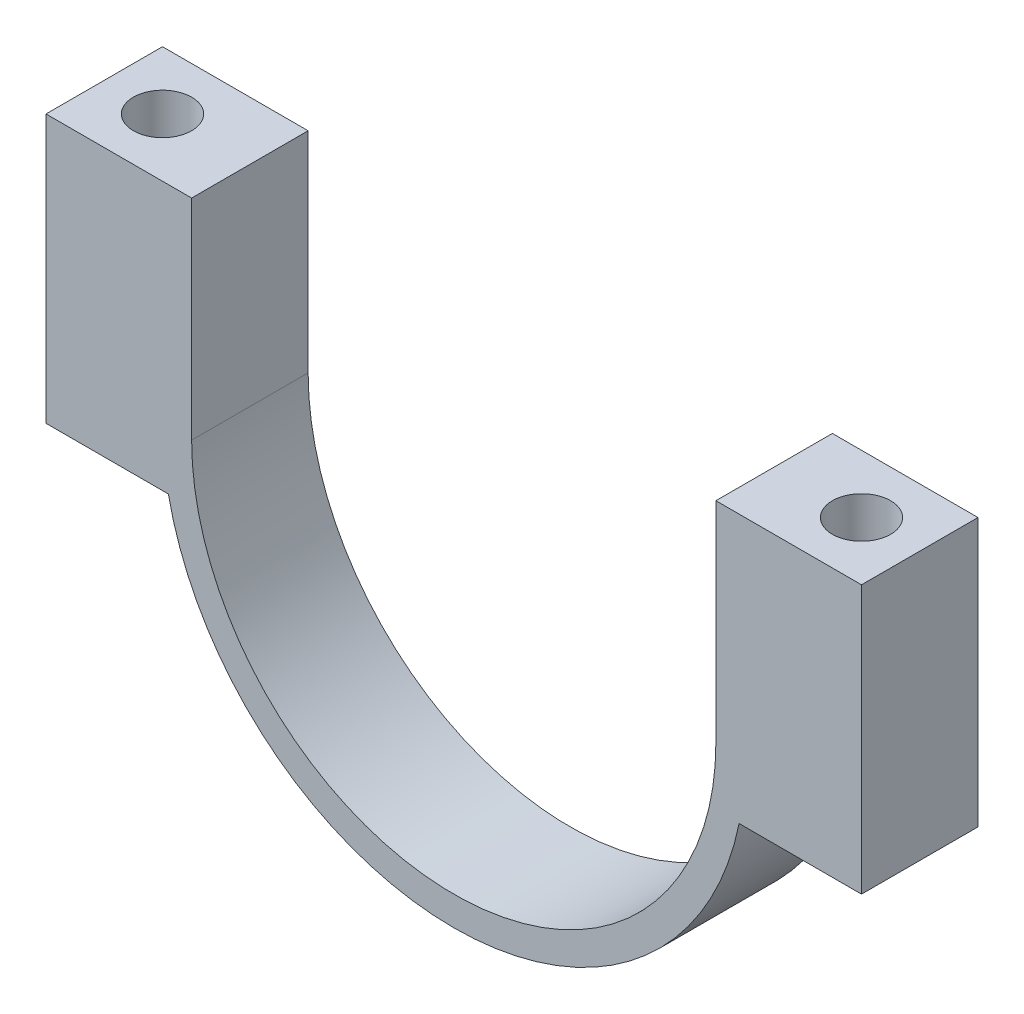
ISO-10303-21;
HEADER;
FILE_DESCRIPTION(('STEP AP214'),'2;1');
FILE_NAME('part.step','',(''),(''),'','','');
FILE_SCHEMA(('AUTOMOTIVE_DESIGN { 1 0 10303 214 1 1 1 1 }'));
ENDSEC;
DATA;
#1=APPLICATION_CONTEXT('core data for automotive mechanical design processes');
#2=APPLICATION_PROTOCOL_DEFINITION('international standard','automotive_design',2000,#1);
#3=PRODUCT_CONTEXT('',#1,'mechanical');
#4=PRODUCT('Part','Part','',(#3));
#5=PRODUCT_RELATED_PRODUCT_CATEGORY('part','',(#4));
#6=PRODUCT_DEFINITION_FORMATION('','',#4);
#7=PRODUCT_DEFINITION_CONTEXT('part definition',#1,'design');
#8=PRODUCT_DEFINITION('design','',#6,#7);
#9=PRODUCT_DEFINITION_SHAPE('','',#8);
#10=(LENGTH_UNIT() NAMED_UNIT(*) SI_UNIT(.MILLI.,.METRE.));
#11=(NAMED_UNIT(*) PLANE_ANGLE_UNIT() SI_UNIT($,.RADIAN.));
#12=(NAMED_UNIT(*) SI_UNIT($,.STERADIAN.) SOLID_ANGLE_UNIT());
#13=UNCERTAINTY_MEASURE_WITH_UNIT(LENGTH_MEASURE(1.E-05),#10,'distance_accuracy_value','');
#14=(GEOMETRIC_REPRESENTATION_CONTEXT(3) GLOBAL_UNCERTAINTY_ASSIGNED_CONTEXT((#13)) GLOBAL_UNIT_ASSIGNED_CONTEXT((#10,
#11,#12)) REPRESENTATION_CONTEXT('',''));
#15=CARTESIAN_POINT('',(0.,0.,0.));
#16=DIRECTION('',(0.,0.,1.));
#17=DIRECTION('',(1.,0.,0.));
#18=AXIS2_PLACEMENT_3D('',#15,#16,#17);
#19=CARTESIAN_POINT('',(70.,0.,20.));
#20=DIRECTION('',(-1.,0.,0.));
#21=DIRECTION('',(0.,0.,1.));
#22=AXIS2_PLACEMENT_3D('',#19,#20,#21);
#23=PLANE('',#22);
#24=DIRECTION('',(0.,1.,0.));
#25=VECTOR('',#24,1.);
#26=CARTESIAN_POINT('',(70.,0.,0.));
#27=LINE('',#26,#25);
#28=CARTESIAN_POINT('',(70.,-10.,0.));
#29=VERTEX_POINT('',#28);
#30=CARTESIAN_POINT('',(70.,36.,0.));
#31=VERTEX_POINT('',#30);
#32=EDGE_CURVE('E119',#29,#31,#27,.T.);
#33=ORIENTED_EDGE('',*,*,#32,.T.);
#34=DIRECTION('',(0.,0.,-1.));
#35=VECTOR('',#34,1.);
#36=CARTESIAN_POINT('',(70.,36.,20.));
#37=LINE('',#36,#35);
#38=CARTESIAN_POINT('',(70.,36.,20.));
#39=VERTEX_POINT('',#38);
#40=EDGE_CURVE('E159',#39,#31,#37,.T.);
#41=ORIENTED_EDGE('',*,*,#40,.F.);
#42=DIRECTION('',(0.,1.,0.));
#43=VECTOR('',#42,1.);
#44=CARTESIAN_POINT('',(70.,0.,20.));
#45=LINE('',#44,#43);
#46=CARTESIAN_POINT('',(70.,-10.,20.));
#47=VERTEX_POINT('',#46);
#48=EDGE_CURVE('E130',#47,#39,#45,.T.);
#49=ORIENTED_EDGE('',*,*,#48,.F.);
#50=DIRECTION('',(0.,0.,-1.));
#51=VECTOR('',#50,1.);
#52=CARTESIAN_POINT('',(70.,-10.,20.));
#53=LINE('',#52,#51);
#54=EDGE_CURVE('E115',#47,#29,#53,.T.);
#55=ORIENTED_EDGE('',*,*,#54,.T.);
#56=EDGE_LOOP('',(#33,#41,#49,#55));
#57=FACE_BOUND('',#56,.T.);
#58=ADVANCED_FACE('F32',(#57),#23,.F.);
#59=CARTESIAN_POINT('',(0.,0.,20.));
#60=DIRECTION('',(0.,0.,-1.));
#61=DIRECTION('',(-1.,0.,0.));
#62=AXIS2_PLACEMENT_3D('',#59,#60,#61);
#63=CYLINDRICAL_SURFACE('',#62,45.);
#64=CARTESIAN_POINT('',(0.,0.,0.));
#65=DIRECTION('',(0.,0.,-1.));
#66=DIRECTION('',(1.,0.,0.));
#67=AXIS2_PLACEMENT_3D('',#64,#65,#66);
#68=CIRCLE('',#67,45.);
#69=CARTESIAN_POINT('',(45.,0.,0.));
#70=VERTEX_POINT('',#69);
#71=CARTESIAN_POINT('',(-45.,0.,0.));
#72=VERTEX_POINT('',#71);
#73=EDGE_CURVE('E122',#70,#72,#68,.T.);
#74=ORIENTED_EDGE('',*,*,#73,.T.);
#75=DIRECTION('',(0.,0.,-1.));
#76=VECTOR('',#75,1.);
#77=CARTESIAN_POINT('',(-45.,0.,20.));
#78=LINE('',#77,#76);
#79=CARTESIAN_POINT('',(-45.,0.,20.));
#80=VERTEX_POINT('',#79);
#81=EDGE_CURVE('E40',#80,#72,#78,.T.);
#82=ORIENTED_EDGE('',*,*,#81,.F.);
#83=CARTESIAN_POINT('',(0.,0.,20.));
#84=DIRECTION('',(0.,0.,-1.));
#85=DIRECTION('',(1.,0.,0.));
#86=AXIS2_PLACEMENT_3D('',#83,#84,#85);
#87=CIRCLE('',#86,45.);
#88=CARTESIAN_POINT('',(45.,0.,20.));
#89=VERTEX_POINT('',#88);
#90=EDGE_CURVE('E83',#89,#80,#87,.T.);
#91=ORIENTED_EDGE('',*,*,#90,.F.);
#92=DIRECTION('',(0.,0.,-1.));
#93=VECTOR('',#92,1.);
#94=CARTESIAN_POINT('',(45.,0.,20.));
#95=LINE('',#94,#93);
#96=EDGE_CURVE('E11',#89,#70,#95,.T.);
#97=ORIENTED_EDGE('',*,*,#96,.T.);
#98=EDGE_LOOP('',(#74,#82,#91,#97));
#99=FACE_BOUND('',#98,.T.);
#100=ADVANCED_FACE('F144',(#99),#63,.F.);
#101=CARTESIAN_POINT('',(-70.,-10.,20.));
#102=DIRECTION('',(1.,0.,0.));
#103=DIRECTION('',(0.,0.,-1.));
#104=AXIS2_PLACEMENT_3D('',#101,#102,#103);
#105=PLANE('',#104);
#106=DIRECTION('',(0.,-1.,0.));
#107=VECTOR('',#106,1.);
#108=CARTESIAN_POINT('',(-70.,-10.,0.));
#109=LINE('',#108,#107);
#110=CARTESIAN_POINT('',(-70.,36.,0.));
#111=VERTEX_POINT('',#110);
#112=CARTESIAN_POINT('',(-70.,-10.,0.));
#113=VERTEX_POINT('',#112);
#114=EDGE_CURVE('E125',#111,#113,#109,.T.);
#115=ORIENTED_EDGE('',*,*,#114,.T.);
#116=DIRECTION('',(0.,0.,-1.));
#117=VECTOR('',#116,1.);
#118=CARTESIAN_POINT('',(-70.,-10.,20.));
#119=LINE('',#118,#117);
#120=CARTESIAN_POINT('',(-70.,-10.,20.));
#121=VERTEX_POINT('',#120);
#122=EDGE_CURVE('E110',#121,#113,#119,.T.);
#123=ORIENTED_EDGE('',*,*,#122,.F.);
#124=DIRECTION('',(0.,-1.,0.));
#125=VECTOR('',#124,1.);
#126=CARTESIAN_POINT('',(-70.,-10.,20.));
#127=LINE('',#126,#125);
#128=CARTESIAN_POINT('',(-70.,36.,20.));
#129=VERTEX_POINT('',#128);
#130=EDGE_CURVE('E101',#129,#121,#127,.T.);
#131=ORIENTED_EDGE('',*,*,#130,.F.);
#132=DIRECTION('',(0.,0.,1.));
#133=VECTOR('',#132,1.);
#134=CARTESIAN_POINT('',(-70.,36.,0.));
#135=LINE('',#134,#133);
#136=EDGE_CURVE('E213',#111,#129,#135,.T.);
#137=ORIENTED_EDGE('',*,*,#136,.F.);
#138=EDGE_LOOP('',(#115,#123,#131,#137));
#139=FACE_BOUND('',#138,.T.);
#140=ADVANCED_FACE('F216',(#139),#105,.F.);
#141=CARTESIAN_POINT('',(-48.9897948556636,-10.,20.));
#142=DIRECTION('',(0.,1.,0.));
#143=DIRECTION('',(0.,0.,1.));
#144=AXIS2_PLACEMENT_3D('',#141,#142,#143);
#145=PLANE('',#144);
#146=CARTESIAN_POINT('',(-60.,-10.,10.0000000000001));
#147=DIRECTION('',(0.,-1.,0.));
#148=DIRECTION('',(-1.,0.,0.));
#149=AXIS2_PLACEMENT_3D('',#146,#147,#148);
#150=CIRCLE('',#149,5.);
#151=CARTESIAN_POINT('',(-65.,-10.,10.0000000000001));
#152=VERTEX_POINT('',#151);
#153=EDGE_CURVE('E181',#152,#152,#150,.T.);
#154=ORIENTED_EDGE('',*,*,#153,.F.);
#155=EDGE_LOOP('',(#154));
#156=FACE_BOUND('',#155,.T.);
#157=DIRECTION('',(1.,0.,0.));
#158=VECTOR('',#157,1.);
#159=CARTESIAN_POINT('',(-48.9897948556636,-10.,0.));
#160=LINE('',#159,#158);
#161=CARTESIAN_POINT('',(-48.9897948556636,-10.,0.));
#162=VERTEX_POINT('',#161);
#163=EDGE_CURVE('E109',#113,#162,#160,.T.);
#164=ORIENTED_EDGE('',*,*,#163,.T.);
#165=DIRECTION('',(0.,0.,-1.));
#166=VECTOR('',#165,1.);
#167=CARTESIAN_POINT('',(-48.9897948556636,-10.,20.));
#168=LINE('',#167,#166);
#169=CARTESIAN_POINT('',(-48.9897948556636,-10.,20.));
#170=VERTEX_POINT('',#169);
#171=EDGE_CURVE('E106',#170,#162,#168,.T.);
#172=ORIENTED_EDGE('',*,*,#171,.F.);
#173=DIRECTION('',(1.,0.,0.));
#174=VECTOR('',#173,1.);
#175=CARTESIAN_POINT('',(-48.9897948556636,-10.,20.));
#176=LINE('',#175,#174);
#177=EDGE_CURVE('E94',#121,#170,#176,.T.);
#178=ORIENTED_EDGE('',*,*,#177,.F.);
#179=ORIENTED_EDGE('',*,*,#122,.T.);
#180=EDGE_LOOP('',(#164,#172,#178,#179));
#181=FACE_BOUND('',#180,.T.);
#182=ADVANCED_FACE('F107',(#156,#181),#145,.F.);
#183=CARTESIAN_POINT('',(0.,0.,20.));
#184=DIRECTION('',(0.,0.,-1.));
#185=DIRECTION('',(-1.,0.,0.));
#186=AXIS2_PLACEMENT_3D('',#183,#184,#185);
#187=CYLINDRICAL_SURFACE('',#186,50.);
#188=CARTESIAN_POINT('',(0.,0.,0.));
#189=DIRECTION('',(0.,0.,1.));
#190=DIRECTION('',(1.,0.,0.));
#191=AXIS2_PLACEMENT_3D('',#188,#189,#190);
#192=CIRCLE('',#191,50.);
#193=CARTESIAN_POINT('',(48.9897948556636,-10.,0.));
#194=VERTEX_POINT('',#193);
#195=EDGE_CURVE('E69',#162,#194,#192,.T.);
#196=ORIENTED_EDGE('',*,*,#195,.T.);
#197=DIRECTION('',(0.,0.,-1.));
#198=VECTOR('',#197,1.);
#199=CARTESIAN_POINT('',(48.9897948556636,-10.,20.));
#200=LINE('',#199,#198);
#201=CARTESIAN_POINT('',(48.9897948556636,-10.,20.));
#202=VERTEX_POINT('',#201);
#203=EDGE_CURVE('E111',#202,#194,#200,.T.);
#204=ORIENTED_EDGE('',*,*,#203,.F.);
#205=CARTESIAN_POINT('',(0.,0.,20.));
#206=DIRECTION('',(0.,0.,1.));
#207=DIRECTION('',(1.,0.,0.));
#208=AXIS2_PLACEMENT_3D('',#205,#206,#207);
#209=CIRCLE('',#208,50.);
#210=EDGE_CURVE('E98',#170,#202,#209,.T.);
#211=ORIENTED_EDGE('',*,*,#210,.F.);
#212=ORIENTED_EDGE('',*,*,#171,.T.);
#213=EDGE_LOOP('',(#196,#204,#211,#212));
#214=FACE_BOUND('',#213,.T.);
#215=ADVANCED_FACE('F113',(#214),#187,.T.);
#216=CARTESIAN_POINT('',(70.,-10.,20.));
#217=DIRECTION('',(0.,1.,0.));
#218=DIRECTION('',(-1.,0.,0.));
#219=AXIS2_PLACEMENT_3D('',#216,#217,#218);
#220=PLANE('',#219);
#221=CARTESIAN_POINT('',(60.,-10.,10.0000000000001));
#222=DIRECTION('',(0.,-1.,0.));
#223=DIRECTION('',(1.,0.,0.));
#224=AXIS2_PLACEMENT_3D('',#221,#222,#223);
#225=CIRCLE('',#224,5.);
#226=CARTESIAN_POINT('',(65.,-10.,10.0000000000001));
#227=VERTEX_POINT('',#226);
#228=EDGE_CURVE('E123',#227,#227,#225,.T.);
#229=ORIENTED_EDGE('',*,*,#228,.F.);
#230=EDGE_LOOP('',(#229));
#231=FACE_BOUND('',#230,.T.);
#232=DIRECTION('',(1.,0.,0.));
#233=VECTOR('',#232,1.);
#234=CARTESIAN_POINT('',(70.,-10.,0.));
#235=LINE('',#234,#233);
#236=EDGE_CURVE('E75',#194,#29,#235,.T.);
#237=ORIENTED_EDGE('',*,*,#236,.T.);
#238=ORIENTED_EDGE('',*,*,#54,.F.);
#239=DIRECTION('',(1.,0.,0.));
#240=VECTOR('',#239,1.);
#241=CARTESIAN_POINT('',(70.,-10.,20.));
#242=LINE('',#241,#240);
#243=EDGE_CURVE('E48',#202,#47,#242,.T.);
#244=ORIENTED_EDGE('',*,*,#243,.F.);
#245=ORIENTED_EDGE('',*,*,#203,.T.);
#246=EDGE_LOOP('',(#237,#238,#244,#245));
#247=FACE_BOUND('',#246,.T.);
#248=ADVANCED_FACE('F260',(#231,#247),#220,.F.);
#249=CARTESIAN_POINT('',(0.,0.,20.));
#250=DIRECTION('',(0.,0.,1.));
#251=DIRECTION('',(1.,0.,0.));
#252=AXIS2_PLACEMENT_3D('',#249,#250,#251);
#253=PLANE('',#252);
#254=ORIENTED_EDGE('',*,*,#48,.T.);
#255=DIRECTION('',(1.,0.,0.));
#256=VECTOR('',#255,1.);
#257=CARTESIAN_POINT('',(45.,36.,20.));
#258=LINE('',#257,#256);
#259=CARTESIAN_POINT('',(45.,36.,20.));
#260=VERTEX_POINT('',#259);
#261=EDGE_CURVE('E173',#260,#39,#258,.T.);
#262=ORIENTED_EDGE('',*,*,#261,.F.);
#263=DIRECTION('',(0.,-1.,0.));
#264=VECTOR('',#263,1.);
#265=CARTESIAN_POINT('',(45.,36.,20.));
#266=LINE('',#265,#264);
#267=EDGE_CURVE('E176',#260,#89,#266,.T.);
#268=ORIENTED_EDGE('',*,*,#267,.T.);
#269=ORIENTED_EDGE('',*,*,#90,.T.);
#270=DIRECTION('',(0.,-1.,0.));
#271=VECTOR('',#270,1.);
#272=CARTESIAN_POINT('',(-45.,36.,20.));
#273=LINE('',#272,#271);
#274=CARTESIAN_POINT('',(-45.,36.,20.));
#275=VERTEX_POINT('',#274);
#276=EDGE_CURVE('E143',#275,#80,#273,.T.);
#277=ORIENTED_EDGE('',*,*,#276,.F.);
#278=DIRECTION('',(1.,0.,0.));
#279=VECTOR('',#278,1.);
#280=CARTESIAN_POINT('',(-70.,36.,20.));
#281=LINE('',#280,#279);
#282=EDGE_CURVE('E161',#129,#275,#281,.T.);
#283=ORIENTED_EDGE('',*,*,#282,.F.);
#284=ORIENTED_EDGE('',*,*,#130,.T.);
#285=ORIENTED_EDGE('',*,*,#177,.T.);
#286=ORIENTED_EDGE('',*,*,#210,.T.);
#287=ORIENTED_EDGE('',*,*,#243,.T.);
#288=EDGE_LOOP('',(#254,#262,#268,#269,#277,#283,#284,#285,#286,#287));
#289=FACE_BOUND('',#288,.T.);
#290=ADVANCED_FACE('F96',(#289),#253,.T.);
#291=CARTESIAN_POINT('',(0.,0.,0.));
#292=DIRECTION('',(0.,0.,1.));
#293=DIRECTION('',(1.,0.,0.));
#294=AXIS2_PLACEMENT_3D('',#291,#292,#293);
#295=PLANE('',#294);
#296=ORIENTED_EDGE('',*,*,#32,.F.);
#297=ORIENTED_EDGE('',*,*,#236,.F.);
#298=ORIENTED_EDGE('',*,*,#195,.F.);
#299=ORIENTED_EDGE('',*,*,#163,.F.);
#300=ORIENTED_EDGE('',*,*,#114,.F.);
#301=DIRECTION('',(-1.,0.,0.));
#302=VECTOR('',#301,1.);
#303=CARTESIAN_POINT('',(-45.,36.,0.));
#304=LINE('',#303,#302);
#305=CARTESIAN_POINT('',(-45.,36.,0.));
#306=VERTEX_POINT('',#305);
#307=EDGE_CURVE('E154',#306,#111,#304,.T.);
#308=ORIENTED_EDGE('',*,*,#307,.F.);
#309=DIRECTION('',(0.,-1.,0.));
#310=VECTOR('',#309,1.);
#311=CARTESIAN_POINT('',(-45.,36.,0.));
#312=LINE('',#311,#310);
#313=EDGE_CURVE('E141',#306,#72,#312,.T.);
#314=ORIENTED_EDGE('',*,*,#313,.T.);
#315=ORIENTED_EDGE('',*,*,#73,.F.);
#316=DIRECTION('',(0.,-1.,0.));
#317=VECTOR('',#316,1.);
#318=CARTESIAN_POINT('',(45.,36.,0.));
#319=LINE('',#318,#317);
#320=CARTESIAN_POINT('',(45.,36.,0.));
#321=VERTEX_POINT('',#320);
#322=EDGE_CURVE('E179',#321,#70,#319,.T.);
#323=ORIENTED_EDGE('',*,*,#322,.F.);
#324=DIRECTION('',(-1.,0.,0.));
#325=VECTOR('',#324,1.);
#326=CARTESIAN_POINT('',(70.,36.,0.));
#327=LINE('',#326,#325);
#328=EDGE_CURVE('E167',#31,#321,#327,.T.);
#329=ORIENTED_EDGE('',*,*,#328,.F.);
#330=EDGE_LOOP('',(#296,#297,#298,#299,#300,#308,#314,#315,#323,#329));
#331=FACE_BOUND('',#330,.T.);
#332=ADVANCED_FACE('F151',(#331),#295,.F.);
#333=CARTESIAN_POINT('',(60.,0.,10.0000000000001));
#334=DIRECTION('',(0.,-1.,0.));
#335=DIRECTION('',(1.,0.,0.));
#336=AXIS2_PLACEMENT_3D('',#333,#334,#335);
#337=CYLINDRICAL_SURFACE('',#336,5.);
#338=ORIENTED_EDGE('',*,*,#228,.T.);
#339=EDGE_LOOP('',(#338));
#340=FACE_BOUND('',#339,.T.);
#341=CARTESIAN_POINT('',(60.,36.,10.0000000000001));
#342=DIRECTION('',(0.,1.,0.));
#343=DIRECTION('',(-1.,0.,0.));
#344=AXIS2_PLACEMENT_3D('',#341,#342,#343);
#345=CIRCLE('',#344,5.);
#346=CARTESIAN_POINT('',(55.,36.,10.0000000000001));
#347=VERTEX_POINT('',#346);
#348=EDGE_CURVE('E156',#347,#347,#345,.T.);
#349=ORIENTED_EDGE('',*,*,#348,.T.);
#350=EDGE_LOOP('',(#349));
#351=FACE_BOUND('',#350,.T.);
#352=ADVANCED_FACE('F247',(#340,#351),#337,.F.);
#353=CARTESIAN_POINT('',(-60.,0.,10.0000000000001));
#354=DIRECTION('',(0.,-1.,0.));
#355=DIRECTION('',(1.,0.,0.));
#356=AXIS2_PLACEMENT_3D('',#353,#354,#355);
#357=CYLINDRICAL_SURFACE('',#356,5.);
#358=ORIENTED_EDGE('',*,*,#153,.T.);
#359=EDGE_LOOP('',(#358));
#360=FACE_BOUND('',#359,.T.);
#361=CARTESIAN_POINT('',(-60.,36.,10.0000000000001));
#362=DIRECTION('',(0.,1.,0.));
#363=DIRECTION('',(-1.,0.,0.));
#364=AXIS2_PLACEMENT_3D('',#361,#362,#363);
#365=CIRCLE('',#364,5.);
#366=CARTESIAN_POINT('',(-65.,36.,10.0000000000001));
#367=VERTEX_POINT('',#366);
#368=EDGE_CURVE('E220',#367,#367,#365,.T.);
#369=ORIENTED_EDGE('',*,*,#368,.T.);
#370=EDGE_LOOP('',(#369));
#371=FACE_BOUND('',#370,.T.);
#372=ADVANCED_FACE('F224',(#360,#371),#357,.F.);
#373=CARTESIAN_POINT('',(0.,36.,0.));
#374=DIRECTION('',(0.,1.,0.));
#375=DIRECTION('',(-1.,0.,0.));
#376=AXIS2_PLACEMENT_3D('',#373,#374,#375);
#377=PLANE('',#376);
#378=ORIENTED_EDGE('',*,*,#40,.T.);
#379=ORIENTED_EDGE('',*,*,#328,.T.);
#380=DIRECTION('',(0.,0.,1.));
#381=VECTOR('',#380,1.);
#382=CARTESIAN_POINT('',(45.,36.,0.));
#383=LINE('',#382,#381);
#384=EDGE_CURVE('E170',#321,#260,#383,.T.);
#385=ORIENTED_EDGE('',*,*,#384,.T.);
#386=ORIENTED_EDGE('',*,*,#261,.T.);
#387=EDGE_LOOP('',(#378,#379,#385,#386));
#388=FACE_BOUND('',#387,.T.);
#389=ORIENTED_EDGE('',*,*,#348,.F.);
#390=EDGE_LOOP('',(#389));
#391=FACE_BOUND('',#390,.T.);
#392=ADVANCED_FACE('F232',(#388,#391),#377,.T.);
#393=CARTESIAN_POINT('',(45.,36.,0.));
#394=DIRECTION('',(1.,0.,0.));
#395=DIRECTION('',(0.,1.,0.));
#396=AXIS2_PLACEMENT_3D('',#393,#394,#395);
#397=PLANE('',#396);
#398=ORIENTED_EDGE('',*,*,#96,.F.);
#399=ORIENTED_EDGE('',*,*,#267,.F.);
#400=ORIENTED_EDGE('',*,*,#384,.F.);
#401=ORIENTED_EDGE('',*,*,#322,.T.);
#402=EDGE_LOOP('',(#398,#399,#400,#401));
#403=FACE_BOUND('',#402,.T.);
#404=ADVANCED_FACE('F193',(#403),#397,.F.);
#405=CARTESIAN_POINT('',(0.,36.,0.));
#406=DIRECTION('',(0.,1.,0.));
#407=DIRECTION('',(-1.,0.,0.));
#408=AXIS2_PLACEMENT_3D('',#405,#406,#407);
#409=PLANE('',#408);
#410=DIRECTION('',(0.,0.,-1.));
#411=VECTOR('',#410,1.);
#412=CARTESIAN_POINT('',(-45.,36.,20.));
#413=LINE('',#412,#411);
#414=EDGE_CURVE('E214',#275,#306,#413,.T.);
#415=ORIENTED_EDGE('',*,*,#414,.T.);
#416=ORIENTED_EDGE('',*,*,#307,.T.);
#417=ORIENTED_EDGE('',*,*,#136,.T.);
#418=ORIENTED_EDGE('',*,*,#282,.T.);
#419=EDGE_LOOP('',(#415,#416,#417,#418));
#420=FACE_BOUND('',#419,.T.);
#421=ORIENTED_EDGE('',*,*,#368,.F.);
#422=EDGE_LOOP('',(#421));
#423=FACE_BOUND('',#422,.T.);
#424=ADVANCED_FACE('F211',(#420,#423),#409,.T.);
#425=CARTESIAN_POINT('',(-45.,36.,20.));
#426=DIRECTION('',(-1.,0.,0.));
#427=DIRECTION('',(0.,-1.,0.));
#428=AXIS2_PLACEMENT_3D('',#425,#426,#427);
#429=PLANE('',#428);
#430=ORIENTED_EDGE('',*,*,#81,.T.);
#431=ORIENTED_EDGE('',*,*,#313,.F.);
#432=ORIENTED_EDGE('',*,*,#414,.F.);
#433=ORIENTED_EDGE('',*,*,#276,.T.);
#434=EDGE_LOOP('',(#430,#431,#432,#433));
#435=FACE_BOUND('',#434,.T.);
#436=ADVANCED_FACE('F137',(#435),#429,.F.);
#437=CLOSED_SHELL('',(#58,#100,#140,#182,#215,#248,#290,#332,#352,#372,#392,#404,#424,#436));
#438=MANIFOLD_SOLID_BREP('B2',#437);
#439=ADVANCED_BREP_SHAPE_REPRESENTATION('',(#18,#438),#14);
#440=SHAPE_DEFINITION_REPRESENTATION(#9,#439);
ENDSEC;
END-ISO-10303-21;
